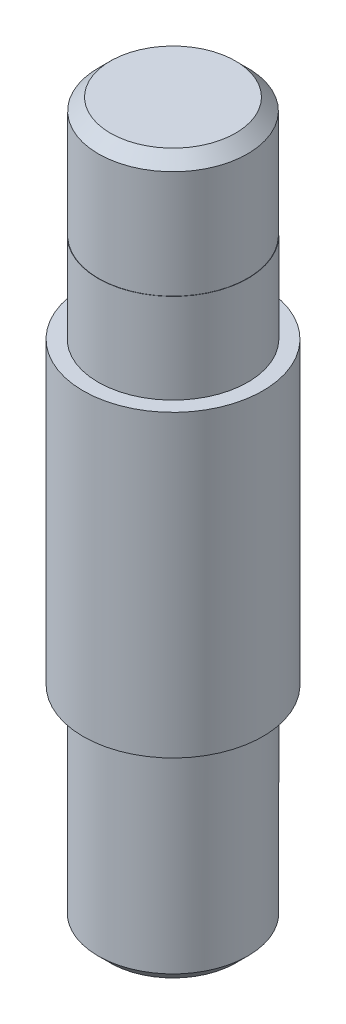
from build123d import *

# Parameters (mm, degrees)
SKETCH1_R      = 3
EXTRUDE1_DEPTH = 10
SKETCH2_R      = 2.5
EXTRUDE2_DEPTH = 3
SKETCH3_R      = 2.49
EXTRUDE3_DEPTH = 4
EXTRUDE4_START = 7
SKETCH4_R      = 2.5
EXTRUDE4_DEPTH = 7
CHAMFER1_SIZE  = 0.4


with BuildPart() as part:
    # Sketch1 → Extrude1 (new body)
    with BuildSketch(Plane(origin=(0, 0, 0), x_dir=(1, 0, 0), z_dir=(0, 1, 0))):
        with Locations(Location((0, 0, 0), (0, 0, 270))):
            Circle(SKETCH1_R)
    extrude(amount=EXTRUDE1_DEPTH)

    # Sketch2 → Extrude2 (add)
    with BuildSketch(Plane(origin=(0, 10, 0), x_dir=(-1, 0, 0), z_dir=(0, 1, 0))):
        with Locations(Location((0, 0, 0), (0, 0, 90))):
            Circle(SKETCH2_R)
    extrude(amount=EXTRUDE2_DEPTH)

    # Sketch3 → Extrude3 (add)
    with BuildSketch(Plane(origin=(0, 13, 0), x_dir=(-1, 0, 0), z_dir=(0, 1, 0))):
        with Locations(Location((0, 0, 0), (0, 0, 90))):
            Circle(SKETCH3_R)
    extrude(amount=EXTRUDE3_DEPTH)

    # Sketch4 → Extrude4 (add)
    with BuildSketch(Plane.XZ.offset(EXTRUDE4_START)):
        with Locations(Location((0, 0, 0), (0, 0, 90))):
            Circle(SKETCH4_R)
    extrude(amount=-EXTRUDE4_DEPTH)

    # Chamfer1
    chamfer1_edges = [part.edges().sort_by_distance(p)[0] for p in [
        (0, 17, -2.49),
        (0, -7, -2.5),
    ]]
    chamfer(chamfer1_edges, length=CHAMFER1_SIZE)


solid = part.part
